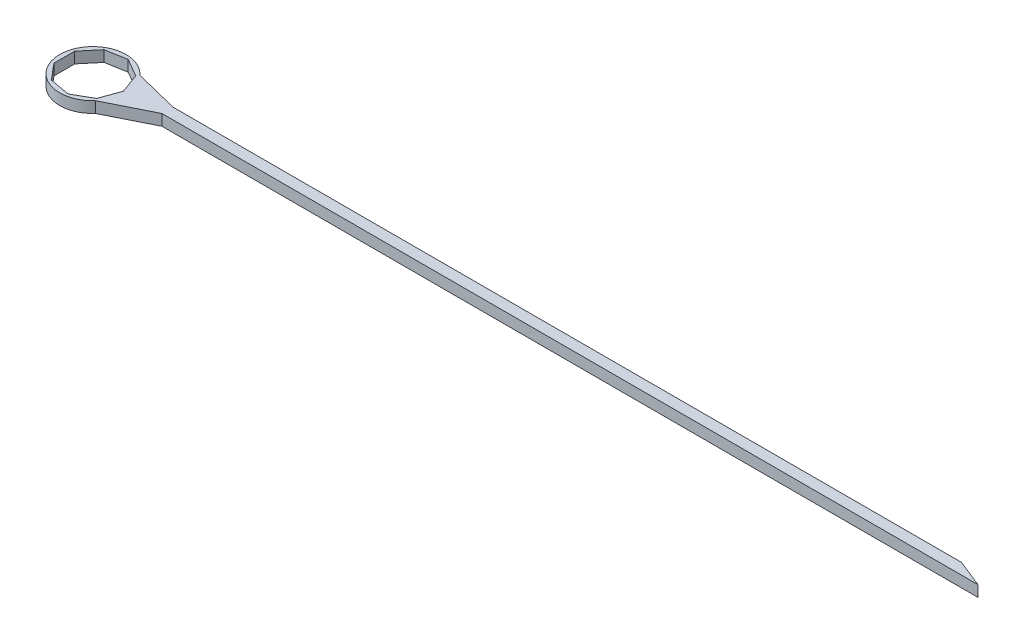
from build123d import *

# Parameters (mm, degrees)
BOSS_EXTRUDE1_DEPTH = 1


with BuildPart() as part:
    # Sketch1 → Boss-Extrude1 (new body)
    with BuildSketch(Plane(origin=(0, 0, 0), x_dir=(1, 0, 0), z_dir=(0, 1, 0))):
        with BuildLine():
            Line((6.236067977, 0), (80, 0))
            Line((80, 0), (77.5, 1))
            Line((77.5, 1), (6.236067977, 1))
            Line((6.236067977, 1), (2.236067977, 2))
            ThreePointArc((2.236067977, 2), (-3, 0), (2.236067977, -2))
            Line((2.236067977, -2), (6.236067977, 0))
        make_face()
        Polygon((2.75, 0), (2.106622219, 1.767665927), (0.477532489, 2.708221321), (-1.375, 2.38156986), (-2.584154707, 0.940555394), (-2.584154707, -0.940555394), (-1.375, -2.38156986), (0.477532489, -2.708221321), (2.106622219, -1.767665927), align=None, mode=Mode.SUBTRACT)
    extrude(amount=BOSS_EXTRUDE1_DEPTH)


solid = part.part
